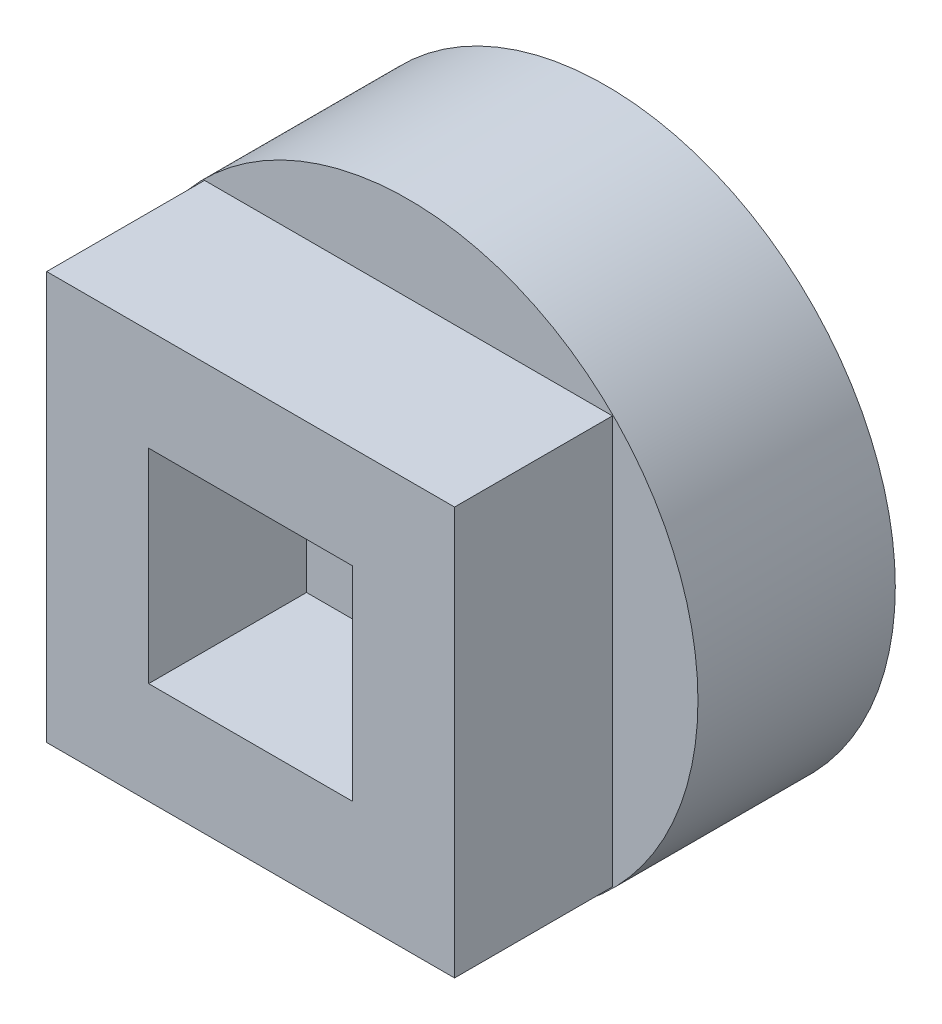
from build123d import *

# Parameters (mm, degrees)
SKETCH1_R           = 11
BOSS_EXTRUDE1_DEPTH = 7.5
SKETCH2_W           = 15.5
SKETCH2_H           = 15.5
BOSS_EXTRUDE2_DEPTH = 6
SKETCH3_W           = 7.75
SKETCH3_H           = 7.75
CUT_EXTRUDE1_DEPTH  = 6


with BuildPart() as part:
    # Sketch1 → Boss-Extrude1 (new body)
    with BuildSketch(Plane.XY):
        Circle(SKETCH1_R)
    extrude(amount=BOSS_EXTRUDE1_DEPTH)

    # Sketch2 → Boss-Extrude2 (add)
    with BuildSketch(Plane.XY.offset(7.5)):
        Rectangle(SKETCH2_W, SKETCH2_H)
    extrude(amount=BOSS_EXTRUDE2_DEPTH)

    # Sketch3 → Cut-Extrude1 (cut)
    with BuildSketch(Plane.XY.offset(13.5)):
        Rectangle(SKETCH3_W, SKETCH3_H)
    extrude(amount=-CUT_EXTRUDE1_DEPTH, mode=Mode.SUBTRACT)


solid = part.part
